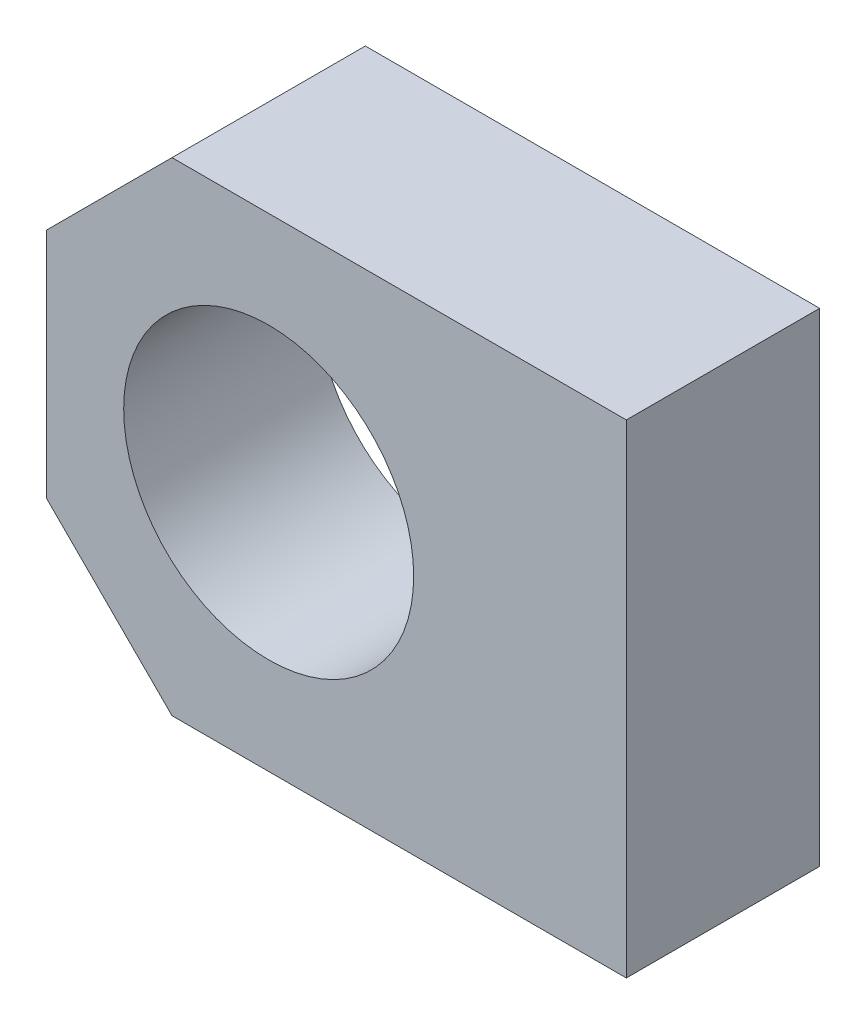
from build123d import *

# Parameters (mm, degrees)
ESQUISSE1_W        = 60
ESQUISSE1_H        = 50
ESQUISSE1_R        = 15
BOSS_EXTRU_1_DEPTH = 20
CHANFREIN1_SIZE    = 13


with BuildPart() as part:
    # Esquisse1 → Boss.-Extru.1 (new body)
    with BuildSketch(Plane.XY):
        with Locations((-30, 25)):
            Rectangle(ESQUISSE1_W, ESQUISSE1_H)
        with Locations((-37, 25)):
            Circle(ESQUISSE1_R, mode=Mode.SUBTRACT)
    extrude(amount=BOSS_EXTRU_1_DEPTH)

    # Chanfrein1
    chanfrein1_edges = [part.edges().sort_by_distance(p)[0] for p in [
        (-60, 0, 10),
        (-60, 50, 10),
    ]]
    chamfer(chanfrein1_edges, length=CHANFREIN1_SIZE)


solid = part.part
